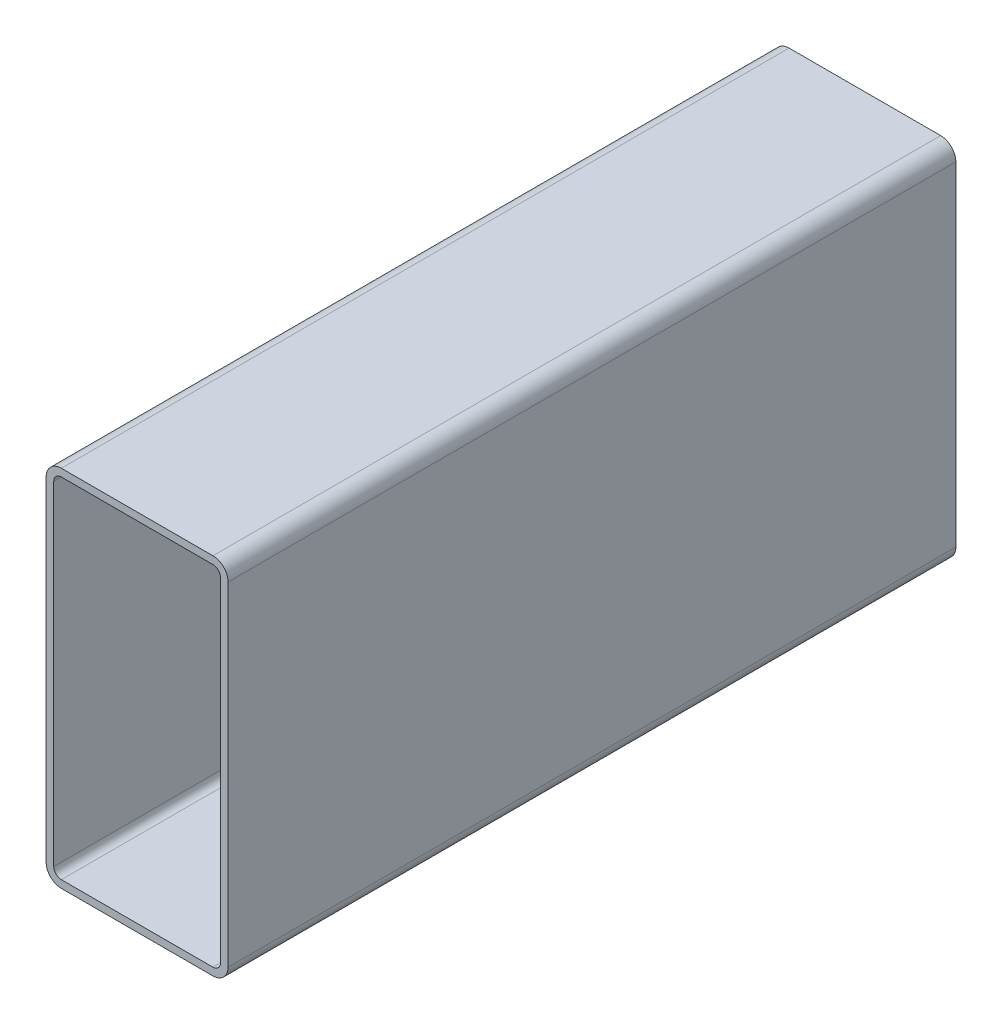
ISO-10303-21;
HEADER;
FILE_DESCRIPTION(('STEP AP214'),'2;1');
FILE_NAME('part.step','',(''),(''),'','','');
FILE_SCHEMA(('AUTOMOTIVE_DESIGN { 1 0 10303 214 1 1 1 1 }'));
ENDSEC;
DATA;
#1=APPLICATION_CONTEXT('core data for automotive mechanical design processes');
#2=APPLICATION_PROTOCOL_DEFINITION('international standard','automotive_design',2000,#1);
#3=PRODUCT_CONTEXT('',#1,'mechanical');
#4=PRODUCT('Part','Part','',(#3));
#5=PRODUCT_RELATED_PRODUCT_CATEGORY('part','',(#4));
#6=PRODUCT_DEFINITION_FORMATION('','',#4);
#7=PRODUCT_DEFINITION_CONTEXT('part definition',#1,'design');
#8=PRODUCT_DEFINITION('design','',#6,#7);
#9=PRODUCT_DEFINITION_SHAPE('','',#8);
#10=(LENGTH_UNIT() NAMED_UNIT(*) SI_UNIT(.MILLI.,.METRE.));
#11=(NAMED_UNIT(*) PLANE_ANGLE_UNIT() SI_UNIT($,.RADIAN.));
#12=(NAMED_UNIT(*) SI_UNIT($,.STERADIAN.) SOLID_ANGLE_UNIT());
#13=UNCERTAINTY_MEASURE_WITH_UNIT(LENGTH_MEASURE(1.E-05),#10,'distance_accuracy_value','');
#14=(GEOMETRIC_REPRESENTATION_CONTEXT(3) GLOBAL_UNCERTAINTY_ASSIGNED_CONTEXT((#13)) GLOBAL_UNIT_ASSIGNED_CONTEXT((#10,
#11,#12)) REPRESENTATION_CONTEXT('',''));
#15=CARTESIAN_POINT('',(0.,0.,0.));
#16=DIRECTION('',(0.,0.,1.));
#17=DIRECTION('',(1.,0.,0.));
#18=AXIS2_PLACEMENT_3D('',#15,#16,#17);
#19=CARTESIAN_POINT('',(8.83911603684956,148.061948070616,304.8));
#20=DIRECTION('',(0.,0.,1.));
#21=DIRECTION('',(1.,0.,0.));
#22=AXIS2_PLACEMENT_3D('',#19,#20,#21);
#23=PLANE('',#22);
#24=CARTESIAN_POINT('',(8.83911603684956,148.061948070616,304.8));
#25=DIRECTION('',(0.,0.,1.));
#26=DIRECTION('',(1.,0.,0.));
#27=AXIS2_PLACEMENT_3D('',#24,#25,#26);
#28=CIRCLE('',#27,6.35);
#29=CARTESIAN_POINT('',(8.83911603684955,154.411948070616,304.8));
#30=VERTEX_POINT('',#29);
#31=CARTESIAN_POINT('',(2.48911603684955,148.061948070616,304.8));
#32=VERTEX_POINT('',#31);
#33=EDGE_CURVE('E211',#30,#32,#28,.T.);
#34=ORIENTED_EDGE('',*,*,#33,.T.);
#35=DIRECTION('',(0.,-1.,0.));
#36=VECTOR('',#35,1.);
#37=CARTESIAN_POINT('',(2.48911603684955,8.36194807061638,304.8));
#38=LINE('',#37,#36);
#39=CARTESIAN_POINT('',(2.48911603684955,8.36194807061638,304.8));
#40=VERTEX_POINT('',#39);
#41=EDGE_CURVE('E214',#32,#40,#38,.T.);
#42=ORIENTED_EDGE('',*,*,#41,.T.);
#43=CARTESIAN_POINT('',(8.83911603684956,8.36194807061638,304.8));
#44=DIRECTION('',(0.,0.,1.));
#45=DIRECTION('',(1.,0.,0.));
#46=AXIS2_PLACEMENT_3D('',#43,#44,#45);
#47=CIRCLE('',#46,6.35);
#48=CARTESIAN_POINT('',(8.83911603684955,2.01194807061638,304.8));
#49=VERTEX_POINT('',#48);
#50=EDGE_CURVE('E217',#40,#49,#47,.T.);
#51=ORIENTED_EDGE('',*,*,#50,.T.);
#52=DIRECTION('',(1.,0.,0.));
#53=VECTOR('',#52,1.);
#54=CARTESIAN_POINT('',(72.3391160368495,2.01194807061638,304.8));
#55=LINE('',#54,#53);
#56=CARTESIAN_POINT('',(72.3391160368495,2.01194807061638,304.8));
#57=VERTEX_POINT('',#56);
#58=EDGE_CURVE('E219',#49,#57,#55,.T.);
#59=ORIENTED_EDGE('',*,*,#58,.T.);
#60=CARTESIAN_POINT('',(72.3391160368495,8.36194807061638,304.8));
#61=DIRECTION('',(0.,0.,1.));
#62=DIRECTION('',(1.,0.,0.));
#63=AXIS2_PLACEMENT_3D('',#60,#61,#62);
#64=CIRCLE('',#63,6.35);
#65=CARTESIAN_POINT('',(78.6891160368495,8.36194807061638,304.8));
#66=VERTEX_POINT('',#65);
#67=EDGE_CURVE('E221',#57,#66,#64,.T.);
#68=ORIENTED_EDGE('',*,*,#67,.T.);
#69=DIRECTION('',(0.,1.,0.));
#70=VECTOR('',#69,1.);
#71=CARTESIAN_POINT('',(78.6891160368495,148.061948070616,304.8));
#72=LINE('',#71,#70);
#73=CARTESIAN_POINT('',(78.6891160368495,148.061948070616,304.8));
#74=VERTEX_POINT('',#73);
#75=EDGE_CURVE('E223',#66,#74,#72,.T.);
#76=ORIENTED_EDGE('',*,*,#75,.T.);
#77=CARTESIAN_POINT('',(72.3391160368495,148.061948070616,304.8));
#78=DIRECTION('',(0.,0.,1.));
#79=DIRECTION('',(1.,0.,0.));
#80=AXIS2_PLACEMENT_3D('',#77,#78,#79);
#81=CIRCLE('',#80,6.34999999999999);
#82=CARTESIAN_POINT('',(72.3391160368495,154.411948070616,304.8));
#83=VERTEX_POINT('',#82);
#84=EDGE_CURVE('E225',#74,#83,#81,.T.);
#85=ORIENTED_EDGE('',*,*,#84,.T.);
#86=DIRECTION('',(-1.,0.,0.));
#87=VECTOR('',#86,1.);
#88=CARTESIAN_POINT('',(8.83911603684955,154.411948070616,304.8));
#89=LINE('',#88,#87);
#90=EDGE_CURVE('E227',#83,#30,#89,.T.);
#91=ORIENTED_EDGE('',*,*,#90,.T.);
#92=EDGE_LOOP('',(#34,#42,#51,#59,#68,#76,#85,#91));
#93=FACE_BOUND('',#92,.T.);
#94=DIRECTION('',(0.,-1.,0.));
#95=VECTOR('',#94,1.);
#96=CARTESIAN_POINT('',(5.66411603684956,8.36194807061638,304.8));
#97=LINE('',#96,#95);
#98=CARTESIAN_POINT('',(5.66411603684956,148.061948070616,304.8));
#99=VERTEX_POINT('',#98);
#100=CARTESIAN_POINT('',(5.66411603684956,8.36194807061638,304.8));
#101=VERTEX_POINT('',#100);
#102=EDGE_CURVE('E154',#99,#101,#97,.T.);
#103=ORIENTED_EDGE('',*,*,#102,.F.);
#104=CARTESIAN_POINT('',(8.83911603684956,148.061948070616,304.8));
#105=DIRECTION('',(0.,0.,1.));
#106=DIRECTION('',(1.,0.,0.));
#107=AXIS2_PLACEMENT_3D('',#104,#105,#106);
#108=CIRCLE('',#107,3.17500000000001);
#109=CARTESIAN_POINT('',(8.83911603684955,151.236948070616,304.8));
#110=VERTEX_POINT('',#109);
#111=EDGE_CURVE('E146',#110,#99,#108,.T.);
#112=ORIENTED_EDGE('',*,*,#111,.F.);
#113=DIRECTION('',(-1.,0.,0.));
#114=VECTOR('',#113,1.);
#115=CARTESIAN_POINT('',(8.83911603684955,151.236948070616,304.8));
#116=LINE('',#115,#114);
#117=CARTESIAN_POINT('',(72.3391160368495,151.236948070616,304.8));
#118=VERTEX_POINT('',#117);
#119=EDGE_CURVE('E179',#118,#110,#116,.T.);
#120=ORIENTED_EDGE('',*,*,#119,.F.);
#121=CARTESIAN_POINT('',(72.3391160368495,148.061948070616,304.8));
#122=DIRECTION('',(0.,0.,1.));
#123=DIRECTION('',(1.,0.,0.));
#124=AXIS2_PLACEMENT_3D('',#121,#122,#123);
#125=CIRCLE('',#124,3.17500000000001);
#126=CARTESIAN_POINT('',(75.5141160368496,148.061948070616,304.8));
#127=VERTEX_POINT('',#126);
#128=EDGE_CURVE('E177',#127,#118,#125,.T.);
#129=ORIENTED_EDGE('',*,*,#128,.F.);
#130=DIRECTION('',(0.,1.,0.));
#131=VECTOR('',#130,1.);
#132=CARTESIAN_POINT('',(75.5141160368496,148.061948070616,304.8));
#133=LINE('',#132,#131);
#134=CARTESIAN_POINT('',(75.5141160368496,8.36194807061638,304.8));
#135=VERTEX_POINT('',#134);
#136=EDGE_CURVE('E175',#135,#127,#133,.T.);
#137=ORIENTED_EDGE('',*,*,#136,.F.);
#138=CARTESIAN_POINT('',(72.3391160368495,8.36194807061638,304.8));
#139=DIRECTION('',(0.,0.,1.));
#140=DIRECTION('',(1.,0.,0.));
#141=AXIS2_PLACEMENT_3D('',#138,#139,#140);
#142=CIRCLE('',#141,3.175);
#143=CARTESIAN_POINT('',(72.3391160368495,5.18694807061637,304.8));
#144=VERTEX_POINT('',#143);
#145=EDGE_CURVE('E173',#144,#135,#142,.T.);
#146=ORIENTED_EDGE('',*,*,#145,.F.);
#147=DIRECTION('',(1.,0.,0.));
#148=VECTOR('',#147,1.);
#149=CARTESIAN_POINT('',(72.3391160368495,5.18694807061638,304.8));
#150=LINE('',#149,#148);
#151=CARTESIAN_POINT('',(8.83911603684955,5.18694807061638,304.8));
#152=VERTEX_POINT('',#151);
#153=EDGE_CURVE('E169',#152,#144,#150,.T.);
#154=ORIENTED_EDGE('',*,*,#153,.F.);
#155=CARTESIAN_POINT('',(8.83911603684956,8.36194807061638,304.8));
#156=DIRECTION('',(0.,0.,1.));
#157=DIRECTION('',(1.,0.,0.));
#158=AXIS2_PLACEMENT_3D('',#155,#156,#157);
#159=CIRCLE('',#158,3.175);
#160=EDGE_CURVE('E167',#101,#152,#159,.T.);
#161=ORIENTED_EDGE('',*,*,#160,.F.);
#162=EDGE_LOOP('',(#103,#112,#120,#129,#137,#146,#154,#161));
#163=FACE_BOUND('',#162,.T.);
#164=ADVANCED_FACE('F33',(#93,#163),#23,.T.);
#165=CARTESIAN_POINT('',(8.83911603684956,148.061948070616,0.));
#166=DIRECTION('',(0.,0.,1.));
#167=DIRECTION('',(1.,0.,0.));
#168=AXIS2_PLACEMENT_3D('',#165,#166,#167);
#169=PLANE('',#168);
#170=CARTESIAN_POINT('',(8.83911603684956,148.061948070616,0.));
#171=DIRECTION('',(0.,0.,1.));
#172=DIRECTION('',(1.,0.,0.));
#173=AXIS2_PLACEMENT_3D('',#170,#171,#172);
#174=CIRCLE('',#173,6.35);
#175=CARTESIAN_POINT('',(8.83911603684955,154.411948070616,0.));
#176=VERTEX_POINT('',#175);
#177=CARTESIAN_POINT('',(2.48911603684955,148.061948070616,0.));
#178=VERTEX_POINT('',#177);
#179=EDGE_CURVE('E162',#176,#178,#174,.T.);
#180=ORIENTED_EDGE('',*,*,#179,.F.);
#181=DIRECTION('',(-1.,0.,0.));
#182=VECTOR('',#181,1.);
#183=CARTESIAN_POINT('',(8.83911603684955,154.411948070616,0.));
#184=LINE('',#183,#182);
#185=CARTESIAN_POINT('',(72.3391160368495,154.411948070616,0.));
#186=VERTEX_POINT('',#185);
#187=EDGE_CURVE('E215',#186,#176,#184,.T.);
#188=ORIENTED_EDGE('',*,*,#187,.F.);
#189=CARTESIAN_POINT('',(72.3391160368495,148.061948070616,0.));
#190=DIRECTION('',(0.,0.,1.));
#191=DIRECTION('',(1.,0.,0.));
#192=AXIS2_PLACEMENT_3D('',#189,#190,#191);
#193=CIRCLE('',#192,6.34999999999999);
#194=CARTESIAN_POINT('',(78.6891160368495,148.061948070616,0.));
#195=VERTEX_POINT('',#194);
#196=EDGE_CURVE('E242',#195,#186,#193,.T.);
#197=ORIENTED_EDGE('',*,*,#196,.F.);
#198=DIRECTION('',(0.,1.,0.));
#199=VECTOR('',#198,1.);
#200=CARTESIAN_POINT('',(78.6891160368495,148.061948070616,0.));
#201=LINE('',#200,#199);
#202=CARTESIAN_POINT('',(78.6891160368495,8.36194807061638,0.));
#203=VERTEX_POINT('',#202);
#204=EDGE_CURVE('E240',#203,#195,#201,.T.);
#205=ORIENTED_EDGE('',*,*,#204,.F.);
#206=CARTESIAN_POINT('',(72.3391160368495,8.36194807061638,0.));
#207=DIRECTION('',(0.,0.,1.));
#208=DIRECTION('',(1.,0.,0.));
#209=AXIS2_PLACEMENT_3D('',#206,#207,#208);
#210=CIRCLE('',#209,6.35);
#211=CARTESIAN_POINT('',(72.3391160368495,2.01194807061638,0.));
#212=VERTEX_POINT('',#211);
#213=EDGE_CURVE('E238',#212,#203,#210,.T.);
#214=ORIENTED_EDGE('',*,*,#213,.F.);
#215=DIRECTION('',(1.,0.,0.));
#216=VECTOR('',#215,1.);
#217=CARTESIAN_POINT('',(72.3391160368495,2.01194807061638,0.));
#218=LINE('',#217,#216);
#219=CARTESIAN_POINT('',(8.83911603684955,2.01194807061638,0.));
#220=VERTEX_POINT('',#219);
#221=EDGE_CURVE('E236',#220,#212,#218,.T.);
#222=ORIENTED_EDGE('',*,*,#221,.F.);
#223=CARTESIAN_POINT('',(8.83911603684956,8.36194807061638,0.));
#224=DIRECTION('',(0.,0.,1.));
#225=DIRECTION('',(1.,0.,0.));
#226=AXIS2_PLACEMENT_3D('',#223,#224,#225);
#227=CIRCLE('',#226,6.35);
#228=CARTESIAN_POINT('',(2.48911603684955,8.36194807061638,0.));
#229=VERTEX_POINT('',#228);
#230=EDGE_CURVE('E234',#229,#220,#227,.T.);
#231=ORIENTED_EDGE('',*,*,#230,.F.);
#232=DIRECTION('',(0.,-1.,0.));
#233=VECTOR('',#232,1.);
#234=CARTESIAN_POINT('',(2.48911603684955,8.36194807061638,0.));
#235=LINE('',#234,#233);
#236=EDGE_CURVE('E232',#178,#229,#235,.T.);
#237=ORIENTED_EDGE('',*,*,#236,.F.);
#238=EDGE_LOOP('',(#180,#188,#197,#205,#214,#222,#231,#237));
#239=FACE_BOUND('',#238,.T.);
#240=CARTESIAN_POINT('',(8.83911603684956,148.061948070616,0.));
#241=DIRECTION('',(0.,0.,1.));
#242=DIRECTION('',(1.,0.,0.));
#243=AXIS2_PLACEMENT_3D('',#240,#241,#242);
#244=CIRCLE('',#243,3.17500000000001);
#245=CARTESIAN_POINT('',(8.83911603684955,151.236948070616,0.));
#246=VERTEX_POINT('',#245);
#247=CARTESIAN_POINT('',(5.66411603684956,148.061948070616,0.));
#248=VERTEX_POINT('',#247);
#249=EDGE_CURVE('E56',#246,#248,#244,.T.);
#250=ORIENTED_EDGE('',*,*,#249,.T.);
#251=DIRECTION('',(0.,-1.,0.));
#252=VECTOR('',#251,1.);
#253=CARTESIAN_POINT('',(5.66411603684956,8.36194807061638,0.));
#254=LINE('',#253,#252);
#255=CARTESIAN_POINT('',(5.66411603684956,8.36194807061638,0.));
#256=VERTEX_POINT('',#255);
#257=EDGE_CURVE('E161',#248,#256,#254,.T.);
#258=ORIENTED_EDGE('',*,*,#257,.T.);
#259=CARTESIAN_POINT('',(8.83911603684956,8.36194807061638,0.));
#260=DIRECTION('',(0.,0.,1.));
#261=DIRECTION('',(1.,0.,0.));
#262=AXIS2_PLACEMENT_3D('',#259,#260,#261);
#263=CIRCLE('',#262,3.175);
#264=CARTESIAN_POINT('',(8.83911603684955,5.18694807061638,0.));
#265=VERTEX_POINT('',#264);
#266=EDGE_CURVE('E183',#256,#265,#263,.T.);
#267=ORIENTED_EDGE('',*,*,#266,.T.);
#268=DIRECTION('',(1.,0.,0.));
#269=VECTOR('',#268,1.);
#270=CARTESIAN_POINT('',(72.3391160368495,5.18694807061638,0.));
#271=LINE('',#270,#269);
#272=CARTESIAN_POINT('',(72.3391160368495,5.18694807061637,0.));
#273=VERTEX_POINT('',#272);
#274=EDGE_CURVE('E186',#265,#273,#271,.T.);
#275=ORIENTED_EDGE('',*,*,#274,.T.);
#276=CARTESIAN_POINT('',(72.3391160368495,8.36194807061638,0.));
#277=DIRECTION('',(0.,0.,1.));
#278=DIRECTION('',(1.,0.,0.));
#279=AXIS2_PLACEMENT_3D('',#276,#277,#278);
#280=CIRCLE('',#279,3.175);
#281=CARTESIAN_POINT('',(75.5141160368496,8.36194807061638,0.));
#282=VERTEX_POINT('',#281);
#283=EDGE_CURVE('E189',#273,#282,#280,.T.);
#284=ORIENTED_EDGE('',*,*,#283,.T.);
#285=DIRECTION('',(0.,1.,0.));
#286=VECTOR('',#285,1.);
#287=CARTESIAN_POINT('',(75.5141160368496,148.061948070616,0.));
#288=LINE('',#287,#286);
#289=CARTESIAN_POINT('',(75.5141160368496,148.061948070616,0.));
#290=VERTEX_POINT('',#289);
#291=EDGE_CURVE('E192',#282,#290,#288,.T.);
#292=ORIENTED_EDGE('',*,*,#291,.T.);
#293=CARTESIAN_POINT('',(72.3391160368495,148.061948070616,0.));
#294=DIRECTION('',(0.,0.,1.));
#295=DIRECTION('',(1.,0.,0.));
#296=AXIS2_PLACEMENT_3D('',#293,#294,#295);
#297=CIRCLE('',#296,3.17500000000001);
#298=CARTESIAN_POINT('',(72.3391160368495,151.236948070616,0.));
#299=VERTEX_POINT('',#298);
#300=EDGE_CURVE('E195',#290,#299,#297,.T.);
#301=ORIENTED_EDGE('',*,*,#300,.T.);
#302=DIRECTION('',(-1.,0.,0.));
#303=VECTOR('',#302,1.);
#304=CARTESIAN_POINT('',(8.83911603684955,151.236948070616,0.));
#305=LINE('',#304,#303);
#306=EDGE_CURVE('E155',#299,#246,#305,.T.);
#307=ORIENTED_EDGE('',*,*,#306,.T.);
#308=EDGE_LOOP('',(#250,#258,#267,#275,#284,#292,#301,#307));
#309=FACE_BOUND('',#308,.T.);
#310=ADVANCED_FACE('F272',(#239,#309),#169,.F.);
#311=CARTESIAN_POINT('',(8.83911603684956,148.061948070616,304.8));
#312=DIRECTION('',(0.,0.,-1.));
#313=DIRECTION('',(-1.,0.,0.));
#314=AXIS2_PLACEMENT_3D('',#311,#312,#313);
#315=CYLINDRICAL_SURFACE('',#314,6.35);
#316=ORIENTED_EDGE('',*,*,#179,.T.);
#317=DIRECTION('',(0.,0.,-1.));
#318=VECTOR('',#317,1.);
#319=CARTESIAN_POINT('',(2.48911603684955,148.061948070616,304.8));
#320=LINE('',#319,#318);
#321=EDGE_CURVE('E11',#32,#178,#320,.T.);
#322=ORIENTED_EDGE('',*,*,#321,.F.);
#323=ORIENTED_EDGE('',*,*,#33,.F.);
#324=DIRECTION('',(0.,0.,-1.));
#325=VECTOR('',#324,1.);
#326=CARTESIAN_POINT('',(8.83911603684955,154.411948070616,304.8));
#327=LINE('',#326,#325);
#328=EDGE_CURVE('E229',#30,#176,#327,.T.);
#329=ORIENTED_EDGE('',*,*,#328,.T.);
#330=EDGE_LOOP('',(#316,#322,#323,#329));
#331=FACE_BOUND('',#330,.T.);
#332=ADVANCED_FACE('F35',(#331),#315,.T.);
#333=CARTESIAN_POINT('',(2.48911603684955,8.36194807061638,304.8));
#334=DIRECTION('',(1.,0.,0.));
#335=DIRECTION('',(0.,0.,-1.));
#336=AXIS2_PLACEMENT_3D('',#333,#334,#335);
#337=PLANE('',#336);
#338=ORIENTED_EDGE('',*,*,#236,.T.);
#339=DIRECTION('',(0.,0.,-1.));
#340=VECTOR('',#339,1.);
#341=CARTESIAN_POINT('',(2.48911603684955,8.36194807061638,304.8));
#342=LINE('',#341,#340);
#343=EDGE_CURVE('E41',#40,#229,#342,.T.);
#344=ORIENTED_EDGE('',*,*,#343,.F.);
#345=ORIENTED_EDGE('',*,*,#41,.F.);
#346=ORIENTED_EDGE('',*,*,#321,.T.);
#347=EDGE_LOOP('',(#338,#344,#345,#346));
#348=FACE_BOUND('',#347,.T.);
#349=ADVANCED_FACE('F289',(#348),#337,.F.);
#350=CARTESIAN_POINT('',(8.83911603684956,8.36194807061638,304.8));
#351=DIRECTION('',(0.,0.,-1.));
#352=DIRECTION('',(-1.,0.,0.));
#353=AXIS2_PLACEMENT_3D('',#350,#351,#352);
#354=CYLINDRICAL_SURFACE('',#353,6.35);
#355=ORIENTED_EDGE('',*,*,#230,.T.);
#356=DIRECTION('',(0.,0.,-1.));
#357=VECTOR('',#356,1.);
#358=CARTESIAN_POINT('',(8.83911603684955,2.01194807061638,304.8));
#359=LINE('',#358,#357);
#360=EDGE_CURVE('E259',#49,#220,#359,.T.);
#361=ORIENTED_EDGE('',*,*,#360,.F.);
#362=ORIENTED_EDGE('',*,*,#50,.F.);
#363=ORIENTED_EDGE('',*,*,#343,.T.);
#364=EDGE_LOOP('',(#355,#361,#362,#363));
#365=FACE_BOUND('',#364,.T.);
#366=ADVANCED_FACE('F266',(#365),#354,.T.);
#367=CARTESIAN_POINT('',(72.3391160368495,2.01194807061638,304.8));
#368=DIRECTION('',(0.,1.,0.));
#369=DIRECTION('',(0.,0.,1.));
#370=AXIS2_PLACEMENT_3D('',#367,#368,#369);
#371=PLANE('',#370);
#372=ORIENTED_EDGE('',*,*,#221,.T.);
#373=DIRECTION('',(0.,0.,-1.));
#374=VECTOR('',#373,1.);
#375=CARTESIAN_POINT('',(72.3391160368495,2.01194807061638,304.8));
#376=LINE('',#375,#374);
#377=EDGE_CURVE('E256',#57,#212,#376,.T.);
#378=ORIENTED_EDGE('',*,*,#377,.F.);
#379=ORIENTED_EDGE('',*,*,#58,.F.);
#380=ORIENTED_EDGE('',*,*,#360,.T.);
#381=EDGE_LOOP('',(#372,#378,#379,#380));
#382=FACE_BOUND('',#381,.T.);
#383=ADVANCED_FACE('F278',(#382),#371,.F.);
#384=CARTESIAN_POINT('',(72.3391160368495,8.36194807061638,304.8));
#385=DIRECTION('',(0.,0.,-1.));
#386=DIRECTION('',(-1.,0.,0.));
#387=AXIS2_PLACEMENT_3D('',#384,#385,#386);
#388=CYLINDRICAL_SURFACE('',#387,6.35);
#389=ORIENTED_EDGE('',*,*,#213,.T.);
#390=DIRECTION('',(0.,0.,-1.));
#391=VECTOR('',#390,1.);
#392=CARTESIAN_POINT('',(78.6891160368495,8.36194807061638,304.8));
#393=LINE('',#392,#391);
#394=EDGE_CURVE('E253',#66,#203,#393,.T.);
#395=ORIENTED_EDGE('',*,*,#394,.F.);
#396=ORIENTED_EDGE('',*,*,#67,.F.);
#397=ORIENTED_EDGE('',*,*,#377,.T.);
#398=EDGE_LOOP('',(#389,#395,#396,#397));
#399=FACE_BOUND('',#398,.T.);
#400=ADVANCED_FACE('F282',(#399),#388,.T.);
#401=CARTESIAN_POINT('',(78.6891160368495,148.061948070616,304.8));
#402=DIRECTION('',(-1.,0.,0.));
#403=DIRECTION('',(0.,0.,1.));
#404=AXIS2_PLACEMENT_3D('',#401,#402,#403);
#405=PLANE('',#404);
#406=ORIENTED_EDGE('',*,*,#204,.T.);
#407=DIRECTION('',(0.,0.,-1.));
#408=VECTOR('',#407,1.);
#409=CARTESIAN_POINT('',(78.6891160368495,148.061948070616,304.8));
#410=LINE('',#409,#408);
#411=EDGE_CURVE('E250',#74,#195,#410,.T.);
#412=ORIENTED_EDGE('',*,*,#411,.F.);
#413=ORIENTED_EDGE('',*,*,#75,.F.);
#414=ORIENTED_EDGE('',*,*,#394,.T.);
#415=EDGE_LOOP('',(#406,#412,#413,#414));
#416=FACE_BOUND('',#415,.T.);
#417=ADVANCED_FACE('F302',(#416),#405,.F.);
#418=CARTESIAN_POINT('',(72.3391160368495,148.061948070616,304.8));
#419=DIRECTION('',(0.,0.,-1.));
#420=DIRECTION('',(-1.,0.,0.));
#421=AXIS2_PLACEMENT_3D('',#418,#419,#420);
#422=CYLINDRICAL_SURFACE('',#421,6.34999999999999);
#423=ORIENTED_EDGE('',*,*,#196,.T.);
#424=DIRECTION('',(0.,0.,-1.));
#425=VECTOR('',#424,1.);
#426=CARTESIAN_POINT('',(72.3391160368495,154.411948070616,304.8));
#427=LINE('',#426,#425);
#428=EDGE_CURVE('E247',#83,#186,#427,.T.);
#429=ORIENTED_EDGE('',*,*,#428,.F.);
#430=ORIENTED_EDGE('',*,*,#84,.F.);
#431=ORIENTED_EDGE('',*,*,#411,.T.);
#432=EDGE_LOOP('',(#423,#429,#430,#431));
#433=FACE_BOUND('',#432,.T.);
#434=ADVANCED_FACE('F300',(#433),#422,.T.);
#435=CARTESIAN_POINT('',(8.83911603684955,154.411948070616,304.8));
#436=DIRECTION('',(0.,-1.,0.));
#437=DIRECTION('',(0.,0.,-1.));
#438=AXIS2_PLACEMENT_3D('',#435,#436,#437);
#439=PLANE('',#438);
#440=ORIENTED_EDGE('',*,*,#187,.T.);
#441=ORIENTED_EDGE('',*,*,#328,.F.);
#442=ORIENTED_EDGE('',*,*,#90,.F.);
#443=ORIENTED_EDGE('',*,*,#428,.T.);
#444=EDGE_LOOP('',(#440,#441,#442,#443));
#445=FACE_BOUND('',#444,.T.);
#446=ADVANCED_FACE('F295',(#445),#439,.F.);
#447=CARTESIAN_POINT('',(8.83911603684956,148.061948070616,304.8));
#448=DIRECTION('',(0.,0.,-1.));
#449=DIRECTION('',(-1.,0.,0.));
#450=AXIS2_PLACEMENT_3D('',#447,#448,#449);
#451=CYLINDRICAL_SURFACE('',#450,3.17500000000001);
#452=ORIENTED_EDGE('',*,*,#249,.F.);
#453=DIRECTION('',(0.,0.,-1.));
#454=VECTOR('',#453,1.);
#455=CARTESIAN_POINT('',(8.83911603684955,151.236948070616,304.8));
#456=LINE('',#455,#454);
#457=EDGE_CURVE('E150',#110,#246,#456,.T.);
#458=ORIENTED_EDGE('',*,*,#457,.F.);
#459=ORIENTED_EDGE('',*,*,#111,.T.);
#460=DIRECTION('',(0.,0.,-1.));
#461=VECTOR('',#460,1.);
#462=CARTESIAN_POINT('',(5.66411603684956,148.061948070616,304.8));
#463=LINE('',#462,#461);
#464=EDGE_CURVE('E149',#99,#248,#463,.T.);
#465=ORIENTED_EDGE('',*,*,#464,.T.);
#466=EDGE_LOOP('',(#452,#458,#459,#465));
#467=FACE_BOUND('',#466,.T.);
#468=ADVANCED_FACE('F148',(#467),#451,.F.);
#469=CARTESIAN_POINT('',(5.66411603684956,8.36194807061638,304.8));
#470=DIRECTION('',(1.,0.,0.));
#471=DIRECTION('',(0.,0.,-1.));
#472=AXIS2_PLACEMENT_3D('',#469,#470,#471);
#473=PLANE('',#472);
#474=ORIENTED_EDGE('',*,*,#257,.F.);
#475=ORIENTED_EDGE('',*,*,#464,.F.);
#476=ORIENTED_EDGE('',*,*,#102,.T.);
#477=DIRECTION('',(0.,0.,-1.));
#478=VECTOR('',#477,1.);
#479=CARTESIAN_POINT('',(5.66411603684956,8.36194807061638,304.8));
#480=LINE('',#479,#478);
#481=EDGE_CURVE('E163',#101,#256,#480,.T.);
#482=ORIENTED_EDGE('',*,*,#481,.T.);
#483=EDGE_LOOP('',(#474,#475,#476,#482));
#484=FACE_BOUND('',#483,.T.);
#485=ADVANCED_FACE('F158',(#484),#473,.T.);
#486=CARTESIAN_POINT('',(8.83911603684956,8.36194807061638,304.8));
#487=DIRECTION('',(0.,0.,-1.));
#488=DIRECTION('',(-1.,0.,0.));
#489=AXIS2_PLACEMENT_3D('',#486,#487,#488);
#490=CYLINDRICAL_SURFACE('',#489,3.175);
#491=ORIENTED_EDGE('',*,*,#266,.F.);
#492=ORIENTED_EDGE('',*,*,#481,.F.);
#493=ORIENTED_EDGE('',*,*,#160,.T.);
#494=DIRECTION('',(0.,0.,-1.));
#495=VECTOR('',#494,1.);
#496=CARTESIAN_POINT('',(8.83911603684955,5.18694807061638,304.8));
#497=LINE('',#496,#495);
#498=EDGE_CURVE('E208',#152,#265,#497,.T.);
#499=ORIENTED_EDGE('',*,*,#498,.T.);
#500=EDGE_LOOP('',(#491,#492,#493,#499));
#501=FACE_BOUND('',#500,.T.);
#502=ADVANCED_FACE('F327',(#501),#490,.F.);
#503=CARTESIAN_POINT('',(72.3391160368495,5.18694807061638,304.8));
#504=DIRECTION('',(0.,1.,0.));
#505=DIRECTION('',(0.,0.,1.));
#506=AXIS2_PLACEMENT_3D('',#503,#504,#505);
#507=PLANE('',#506);
#508=ORIENTED_EDGE('',*,*,#274,.F.);
#509=ORIENTED_EDGE('',*,*,#498,.F.);
#510=ORIENTED_EDGE('',*,*,#153,.T.);
#511=DIRECTION('',(0.,0.,-1.));
#512=VECTOR('',#511,1.);
#513=CARTESIAN_POINT('',(72.3391160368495,5.18694807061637,304.8));
#514=LINE('',#513,#512);
#515=EDGE_CURVE('E206',#144,#273,#514,.T.);
#516=ORIENTED_EDGE('',*,*,#515,.T.);
#517=EDGE_LOOP('',(#508,#509,#510,#516));
#518=FACE_BOUND('',#517,.T.);
#519=ADVANCED_FACE('F331',(#518),#507,.T.);
#520=CARTESIAN_POINT('',(72.3391160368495,8.36194807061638,304.8));
#521=DIRECTION('',(0.,0.,-1.));
#522=DIRECTION('',(-1.,0.,0.));
#523=AXIS2_PLACEMENT_3D('',#520,#521,#522);
#524=CYLINDRICAL_SURFACE('',#523,3.175);
#525=ORIENTED_EDGE('',*,*,#283,.F.);
#526=ORIENTED_EDGE('',*,*,#515,.F.);
#527=ORIENTED_EDGE('',*,*,#145,.T.);
#528=DIRECTION('',(0.,0.,-1.));
#529=VECTOR('',#528,1.);
#530=CARTESIAN_POINT('',(75.5141160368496,8.36194807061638,304.8));
#531=LINE('',#530,#529);
#532=EDGE_CURVE('E204',#135,#282,#531,.T.);
#533=ORIENTED_EDGE('',*,*,#532,.T.);
#534=EDGE_LOOP('',(#525,#526,#527,#533));
#535=FACE_BOUND('',#534,.T.);
#536=ADVANCED_FACE('F337',(#535),#524,.F.);
#537=CARTESIAN_POINT('',(75.5141160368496,148.061948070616,304.8));
#538=DIRECTION('',(-1.,0.,0.));
#539=DIRECTION('',(0.,0.,1.));
#540=AXIS2_PLACEMENT_3D('',#537,#538,#539);
#541=PLANE('',#540);
#542=ORIENTED_EDGE('',*,*,#291,.F.);
#543=ORIENTED_EDGE('',*,*,#532,.F.);
#544=ORIENTED_EDGE('',*,*,#136,.T.);
#545=DIRECTION('',(0.,0.,-1.));
#546=VECTOR('',#545,1.);
#547=CARTESIAN_POINT('',(75.5141160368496,148.061948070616,304.8));
#548=LINE('',#547,#546);
#549=EDGE_CURVE('E202',#127,#290,#548,.T.);
#550=ORIENTED_EDGE('',*,*,#549,.T.);
#551=EDGE_LOOP('',(#542,#543,#544,#550));
#552=FACE_BOUND('',#551,.T.);
#553=ADVANCED_FACE('F341',(#552),#541,.T.);
#554=CARTESIAN_POINT('',(72.3391160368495,148.061948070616,304.8));
#555=DIRECTION('',(0.,0.,-1.));
#556=DIRECTION('',(-1.,0.,0.));
#557=AXIS2_PLACEMENT_3D('',#554,#555,#556);
#558=CYLINDRICAL_SURFACE('',#557,3.17500000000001);
#559=ORIENTED_EDGE('',*,*,#300,.F.);
#560=ORIENTED_EDGE('',*,*,#549,.F.);
#561=ORIENTED_EDGE('',*,*,#128,.T.);
#562=DIRECTION('',(0.,0.,-1.));
#563=VECTOR('',#562,1.);
#564=CARTESIAN_POINT('',(72.3391160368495,151.236948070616,304.8));
#565=LINE('',#564,#563);
#566=EDGE_CURVE('E48',#118,#299,#565,.T.);
#567=ORIENTED_EDGE('',*,*,#566,.T.);
#568=EDGE_LOOP('',(#559,#560,#561,#567));
#569=FACE_BOUND('',#568,.T.);
#570=ADVANCED_FACE('F345',(#569),#558,.F.);
#571=CARTESIAN_POINT('',(8.83911603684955,151.236948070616,304.8));
#572=DIRECTION('',(0.,-1.,0.));
#573=DIRECTION('',(0.,0.,-1.));
#574=AXIS2_PLACEMENT_3D('',#571,#572,#573);
#575=PLANE('',#574);
#576=ORIENTED_EDGE('',*,*,#306,.F.);
#577=ORIENTED_EDGE('',*,*,#566,.F.);
#578=ORIENTED_EDGE('',*,*,#119,.T.);
#579=ORIENTED_EDGE('',*,*,#457,.T.);
#580=EDGE_LOOP('',(#576,#577,#578,#579));
#581=FACE_BOUND('',#580,.T.);
#582=ADVANCED_FACE('F349',(#581),#575,.T.);
#583=CLOSED_SHELL('',(#164,#310,#332,#349,#366,#383,#400,#417,#434,#446,#468,#485,#502,#519,
#536,#553,#570,#582));
#584=MANIFOLD_SOLID_BREP('B2',#583);
#585=ADVANCED_BREP_SHAPE_REPRESENTATION('',(#18,#584),#14);
#586=SHAPE_DEFINITION_REPRESENTATION(#9,#585);
ENDSEC;
END-ISO-10303-21;
